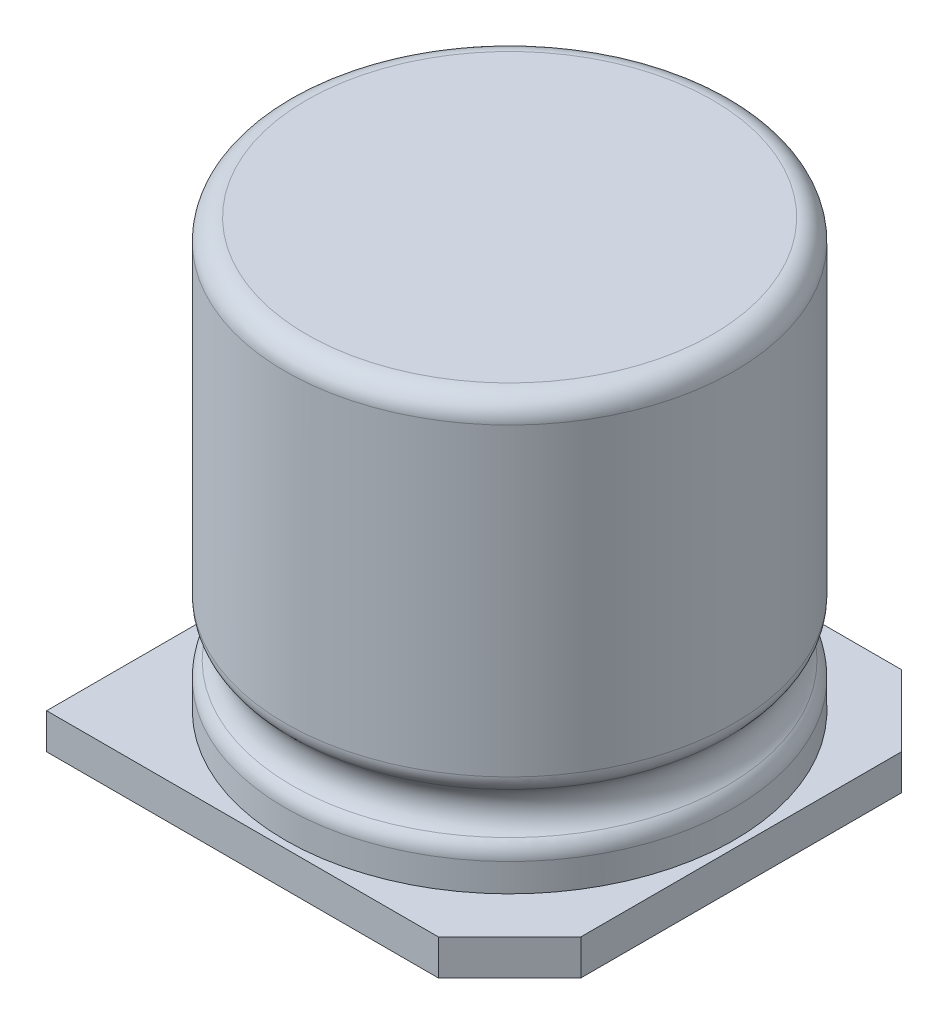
ISO-10303-21;
HEADER;
FILE_DESCRIPTION(('STEP AP214'),'2;1');
FILE_NAME('part.step','',(''),(''),'','','');
FILE_SCHEMA(('AUTOMOTIVE_DESIGN { 1 0 10303 214 1 1 1 1 }'));
ENDSEC;
DATA;
#1=APPLICATION_CONTEXT('core data for automotive mechanical design processes');
#2=APPLICATION_PROTOCOL_DEFINITION('international standard','automotive_design',2000,#1);
#3=PRODUCT_CONTEXT('',#1,'mechanical');
#4=PRODUCT('Part','Part','',(#3));
#5=PRODUCT_RELATED_PRODUCT_CATEGORY('part','',(#4));
#6=PRODUCT_DEFINITION_FORMATION('','',#4);
#7=PRODUCT_DEFINITION_CONTEXT('part definition',#1,'design');
#8=PRODUCT_DEFINITION('design','',#6,#7);
#9=PRODUCT_DEFINITION_SHAPE('','',#8);
#10=(LENGTH_UNIT() NAMED_UNIT(*) SI_UNIT(.MILLI.,.METRE.));
#11=(NAMED_UNIT(*) PLANE_ANGLE_UNIT() SI_UNIT($,.RADIAN.));
#12=(NAMED_UNIT(*) SI_UNIT($,.STERADIAN.) SOLID_ANGLE_UNIT());
#13=UNCERTAINTY_MEASURE_WITH_UNIT(LENGTH_MEASURE(1.E-05),#10,'distance_accuracy_value','');
#14=(GEOMETRIC_REPRESENTATION_CONTEXT(3) GLOBAL_UNCERTAINTY_ASSIGNED_CONTEXT((#13)) GLOBAL_UNIT_ASSIGNED_CONTEXT((#10,
#11,#12)) REPRESENTATION_CONTEXT('',''));
#15=CARTESIAN_POINT('',(0.,0.,0.));
#16=DIRECTION('',(0.,0.,1.));
#17=DIRECTION('',(1.,0.,0.));
#18=AXIS2_PLACEMENT_3D('',#15,#16,#17);
#19=CARTESIAN_POINT('',(27.23190081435,15.9331409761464,-31.0464200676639));
#20=DIRECTION('',(0.,1.,0.));
#21=DIRECTION('',(-1.,0.,0.));
#22=AXIS2_PLACEMENT_3D('',#19,#20,#21);
#23=PLANE('',#22);
#24=CARTESIAN_POINT('',(21.58548081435,15.9331409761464,-25.4000000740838));
#25=DIRECTION('',(0.,-1.,0.));
#26=DIRECTION('',(1.,0.,1.39308271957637E-12));
#27=AXIS2_PLACEMENT_3D('',#24,#25,#26);
#28=CIRCLE('',#27,5.42924999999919);
#29=CARTESIAN_POINT('',(16.1562308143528,15.9331409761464,-25.4000000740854));
#30=VERTEX_POINT('',#29);
#31=CARTESIAN_POINT('',(27.0147308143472,15.9331409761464,-25.4000000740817));
#32=VERTEX_POINT('',#31);
#33=EDGE_CURVE('E102',#30,#32,#28,.F.);
#34=ORIENTED_EDGE('',*,*,#33,.T.);
#35=CARTESIAN_POINT('',(16.1562308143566,15.9331409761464,-25.4000000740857));
#36=CARTESIAN_POINT('',(16.1562306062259,15.9331409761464,-25.4323033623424));
#37=CARTESIAN_POINT('',(16.1565187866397,15.9331409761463,-25.4646066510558));
#38=CARTESIAN_POINT('',(16.1576716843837,15.9331409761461,-25.529202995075));
#39=CARTESIAN_POINT('',(16.1585364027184,15.933140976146,-25.5614960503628));
#40=CARTESIAN_POINT('',(16.1608421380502,15.9331409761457,-25.6260616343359));
#41=CARTESIAN_POINT('',(16.1622831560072,15.9331409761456,-25.6583341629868));
#42=CARTESIAN_POINT('',(16.1657410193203,15.9331409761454,-25.7228484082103));
#43=CARTESIAN_POINT('',(16.1677578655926,15.9331409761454,-25.7550901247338));
#44=CARTESIAN_POINT('',(16.1723667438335,15.9331409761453,-25.8195324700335));
#45=CARTESIAN_POINT('',(16.1749587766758,15.9331409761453,-25.8517330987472));
#46=CARTESIAN_POINT('',(16.1807171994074,15.9331409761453,-25.9160830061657));
#47=CARTESIAN_POINT('',(16.1838835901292,15.9331409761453,-25.948232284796));
#48=CARTESIAN_POINT('',(16.1907897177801,15.9331409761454,-26.0124692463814));
#49=CARTESIAN_POINT('',(16.1945294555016,15.9331409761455,-26.0445569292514));
#50=CARTESIAN_POINT('',(16.2025810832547,15.9331409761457,-26.1086604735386));
#51=CARTESIAN_POINT('',(16.20689297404,15.9331409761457,-26.1406763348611));
#52=CARTESIAN_POINT('',(16.2160875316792,15.9331409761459,-26.2046260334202));
#53=CARTESIAN_POINT('',(16.2209701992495,15.933140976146,-26.2365598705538));
#54=CARTESIAN_POINT('',(16.2313047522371,15.9331409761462,-26.3003353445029));
#55=CARTESIAN_POINT('',(16.2367566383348,15.9331409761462,-26.3321769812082));
#56=CARTESIAN_POINT('',(16.2482278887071,15.9331409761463,-26.3957579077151));
#57=CARTESIAN_POINT('',(16.2542472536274,15.9331409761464,-26.4274971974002));
#58=CARTESIAN_POINT('',(16.2668515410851,15.9331409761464,-26.4908633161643));
#59=CARTESIAN_POINT('',(16.2734364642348,15.9331409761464,-26.5224901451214));
#60=CARTESIAN_POINT('',(16.287169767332,15.9331409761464,-26.5856212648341));
#61=CARTESIAN_POINT('',(16.29431814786,15.9331409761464,-26.6171255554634));
#62=CARTESIAN_POINT('',(16.309176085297,15.9331409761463,-26.6800015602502));
#63=CARTESIAN_POINT('',(16.3168856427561,15.9331409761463,-26.7113732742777));
#64=CARTESIAN_POINT('',(16.3328634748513,15.9331409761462,-26.7739741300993));
#65=CARTESIAN_POINT('',(16.3411317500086,15.9331409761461,-26.8052032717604));
#66=CARTESIAN_POINT('',(16.3582243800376,15.9331409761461,-26.8675090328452));
#67=CARTESIAN_POINT('',(16.3670487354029,15.933140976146,-26.8985856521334));
#68=CARTESIAN_POINT('',(16.3852507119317,15.933140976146,-26.9605764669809));
#69=CARTESIAN_POINT('',(16.3946283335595,15.933140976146,-26.9914906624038));
#70=CARTESIAN_POINT('',(16.413933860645,15.933140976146,-27.053146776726));
#71=CARTESIAN_POINT('',(16.4238617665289,15.933140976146,-27.083888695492));
#72=CARTESIAN_POINT('',(16.4442647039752,15.9331409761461,-27.1451904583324));
#73=CARTESIAN_POINT('',(16.4547397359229,15.9331409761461,-27.1757503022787));
#74=CARTESIAN_POINT('',(16.4762335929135,15.9331409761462,-27.2366781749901));
#75=CARTESIAN_POINT('',(16.4872524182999,15.9331409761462,-27.2670462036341));
#76=CARTESIAN_POINT('',(16.5098303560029,15.9331409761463,-27.3275807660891));
#77=CARTESIAN_POINT('',(16.5213894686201,15.9331409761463,-27.3577472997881));
#78=CARTESIAN_POINT('',(16.5450443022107,15.9331409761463,-27.4178692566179));
#79=CARTESIAN_POINT('',(16.557140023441,15.9331409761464,-27.4478246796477));
#80=CARTESIAN_POINT('',(16.5818642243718,15.9331409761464,-27.507514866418));
#81=CARTESIAN_POINT('',(16.5944927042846,15.9331409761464,-27.5372496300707));
#82=CARTESIAN_POINT('',(16.6202784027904,15.9331409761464,-27.5964890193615));
#83=CARTESIAN_POINT('',(16.6334356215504,15.9331409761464,-27.6259936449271));
#84=CARTESIAN_POINT('',(16.6602746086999,15.9331409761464,-27.6847633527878));
#85=CARTESIAN_POINT('',(16.6739563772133,15.9331409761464,-27.7140284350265));
#86=CARTESIAN_POINT('',(16.7018401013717,15.9331409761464,-27.7723097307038));
#87=CARTESIAN_POINT('',(16.7160420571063,15.9331409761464,-27.8013259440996));
#88=CARTESIAN_POINT('',(16.7449616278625,15.9331409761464,-27.8591002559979));
#89=CARTESIAN_POINT('',(16.7596792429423,15.9331409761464,-27.8878583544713));
#90=CARTESIAN_POINT('',(16.7896254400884,15.9331409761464,-27.9451072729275));
#91=CARTESIAN_POINT('',(16.8048540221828,15.9331409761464,-27.9735980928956));
#92=CARTESIAN_POINT('',(16.8358172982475,15.9331409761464,-28.030303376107));
#93=CARTESIAN_POINT('',(16.851551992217,15.9331409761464,-28.0585178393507));
#94=CARTESIAN_POINT('',(16.883522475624,15.9331409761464,-28.1146614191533));
#95=CARTESIAN_POINT('',(16.8997582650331,15.9331409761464,-28.1425905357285));
#96=CARTESIAN_POINT('',(16.9327257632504,15.9331409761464,-28.1981545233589));
#97=CARTESIAN_POINT('',(16.9494574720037,15.9331409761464,-28.2257893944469));
#98=CARTESIAN_POINT('',(16.9834114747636,15.9331409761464,-28.2807560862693));
#99=CARTESIAN_POINT('',(17.00063376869,15.9331409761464,-28.3080879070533));
#100=CARTESIAN_POINT('',(17.0355634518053,15.9331409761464,-28.3624397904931));
#101=CARTESIAN_POINT('',(17.0532708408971,15.9331409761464,-28.3894598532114));
#102=CARTESIAN_POINT('',(17.0891650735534,15.9331409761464,-28.4431796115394));
#103=CARTESIAN_POINT('',(17.1073519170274,15.9331409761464,-28.4698793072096));
#104=CARTESIAN_POINT('',(17.1441992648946,15.9331409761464,-28.522949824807));
#105=CARTESIAN_POINT('',(17.1628597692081,15.9331409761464,-28.5493206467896));
#106=CARTESIAN_POINT('',(17.2006484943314,15.9331409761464,-28.6017250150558));
#107=CARTESIAN_POINT('',(17.2197767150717,15.9331409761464,-28.6277585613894));
#108=CARTESIAN_POINT('',(17.2584947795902,15.9331409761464,-28.6794800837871));
#109=CARTESIAN_POINT('',(17.2780846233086,15.9331409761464,-28.7051680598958));
#110=CARTESIAN_POINT('',(17.3177196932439,15.9331409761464,-28.7561902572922));
#111=CARTESIAN_POINT('',(17.3377649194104,15.9331409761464,-28.7815244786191));
#112=CARTESIAN_POINT('',(17.3783043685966,15.9331409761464,-28.8318310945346));
#113=CARTESIAN_POINT('',(17.3987985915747,15.9331409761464,-28.8568034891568));
#114=CARTESIAN_POINT('',(17.440229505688,15.9331409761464,-28.906378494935));
#115=CARTESIAN_POINT('',(17.4611661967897,15.9331409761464,-28.9309811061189));
#116=CARTESIAN_POINT('',(17.503475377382,15.9331409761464,-28.9798087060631));
#117=CARTESIAN_POINT('',(17.5248478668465,15.9331409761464,-29.0040336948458));
#118=CARTESIAN_POINT('',(17.5680218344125,15.9331409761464,-29.0520983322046));
#119=CARTESIAN_POINT('',(17.5898233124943,15.9331409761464,-29.0759379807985));
#120=CARTESIAN_POINT('',(17.6338483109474,15.9331409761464,-29.1232243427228));
#121=CARTESIAN_POINT('',(17.656071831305,15.9331409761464,-29.1466710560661));
#122=CARTESIAN_POINT('',(17.7009338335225,15.9331409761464,-29.1931640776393));
#123=CARTESIAN_POINT('',(17.7235723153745,15.9331409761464,-29.2162103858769));
#124=CARTESIAN_POINT('',(17.7692570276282,15.9331409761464,-29.2618952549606));
#125=CARTESIAN_POINT('',(17.7923032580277,15.9331409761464,-29.2845338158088));
#126=CARTESIAN_POINT('',(17.8387961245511,15.9331409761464,-29.329395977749));
#127=CARTESIAN_POINT('',(17.8622427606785,15.9331409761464,-29.3516195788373));
#128=CARTESIAN_POINT('',(17.9095289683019,15.9331409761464,-29.3956447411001));
#129=CARTESIAN_POINT('',(17.9333685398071,15.9331409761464,-29.4174463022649));
#130=CARTESIAN_POINT('',(17.9814330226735,15.9331409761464,-29.4606204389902));
#131=CARTESIAN_POINT('',(18.0056579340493,15.9331409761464,-29.4819930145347));
#132=CARTESIAN_POINT('',(18.0544853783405,15.9331409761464,-29.524302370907));
#133=CARTESIAN_POINT('',(18.0790879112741,15.9331409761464,-29.5452391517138));
#134=CARTESIAN_POINT('',(18.1286627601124,15.9331409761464,-29.5866702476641));
#135=CARTESIAN_POINT('',(18.1536350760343,15.9331409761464,-29.6071645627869));
#136=CARTESIAN_POINT('',(18.203941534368,15.9331409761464,-29.6477041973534));
#137=CARTESIAN_POINT('',(18.2292756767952,15.9331409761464,-29.6677495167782));
#138=CARTESIAN_POINT('',(18.2802977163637,15.9331409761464,-29.7073847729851));
#139=CARTESIAN_POINT('',(18.3059856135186,15.9331409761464,-29.72697470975));
#140=CARTESIAN_POINT('',(18.3577069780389,15.9331409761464,-29.7656929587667));
#141=CARTESIAN_POINT('',(18.383740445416,15.9331409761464,-29.7848212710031));
#142=CARTESIAN_POINT('',(18.4361446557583,15.9331409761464,-29.8226101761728));
#143=CARTESIAN_POINT('',(18.4625153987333,15.9331409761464,-29.8412707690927));
#144=CARTESIAN_POINT('',(18.5155857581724,15.9331409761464,-29.8781182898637));
#145=CARTESIAN_POINT('',(18.5422853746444,15.9331409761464,-29.8963052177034));
#146=CARTESIAN_POINT('',(18.5960049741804,15.9331409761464,-29.9321996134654));
#147=CARTESIAN_POINT('',(18.6230249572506,15.9331409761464,-29.9499070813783));
#148=CARTESIAN_POINT('',(18.6773766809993,15.9331409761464,-29.9848369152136));
#149=CARTESIAN_POINT('',(18.7047084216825,15.9331409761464,-30.0020592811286));
#150=CARTESIAN_POINT('',(18.7596749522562,15.9331409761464,-30.0360134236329));
#151=CARTESIAN_POINT('',(18.7873097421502,15.9331409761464,-30.0527452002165));
#152=CARTESIAN_POINT('',(18.8428735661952,15.9331409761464,-30.0857128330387));
#153=CARTESIAN_POINT('',(18.8708026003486,15.9331409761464,-30.1019486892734));
#154=CARTESIAN_POINT('',(18.9269460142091,15.9331409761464,-30.1339193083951));
#155=CARTESIAN_POINT('',(18.9551603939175,15.9331409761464,-30.14965407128));
#156=CARTESIAN_POINT('',(19.0118655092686,15.9331409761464,-30.1806174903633));
#157=CARTESIAN_POINT('',(19.0403562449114,15.9331409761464,-30.1958461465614));
#158=CARTESIAN_POINT('',(19.0976049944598,15.9331409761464,-30.2257925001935));
#159=CARTESIAN_POINT('',(19.1263630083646,15.9331409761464,-30.2405101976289));
#160=CARTESIAN_POINT('',(19.184137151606,15.9331409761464,-30.2694299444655));
#161=CARTESIAN_POINT('',(19.2131532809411,15.9331409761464,-30.2836319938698));
#162=CARTESIAN_POINT('',(19.2714344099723,15.9331409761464,-30.3115159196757));
#163=CARTESIAN_POINT('',(19.3006994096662,15.9331409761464,-30.3251977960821));
#164=CARTESIAN_POINT('',(19.3594689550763,15.9331409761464,-30.3520370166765));
#165=CARTESIAN_POINT('',(19.3889735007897,15.9331409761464,-30.3651943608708));
#166=CARTESIAN_POINT('',(19.4482127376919,15.9331409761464,-30.3909803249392));
#167=CARTESIAN_POINT('',(19.4779474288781,15.9331409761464,-30.4036089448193));
#168=CARTESIAN_POINT('',(19.5376374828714,15.9331409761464,-30.4283334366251));
#169=CARTESIAN_POINT('',(19.5675928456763,15.9331409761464,-30.4404293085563));
#170=CARTESIAN_POINT('',(19.6277146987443,15.9331409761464,-30.4640844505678));
#171=CARTESIAN_POINT('',(19.6578811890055,15.9331409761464,-30.475643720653));
#172=CARTESIAN_POINT('',(19.7184156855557,15.9331409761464,-30.4982219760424));
#173=CARTESIAN_POINT('',(19.7487836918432,15.9331409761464,-30.5092409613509));
#174=CARTESIAN_POINT('',(19.8097115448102,15.9331409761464,-30.5307351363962));
#175=CARTESIAN_POINT('',(19.8402713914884,15.9331409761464,-30.5412103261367));
#176=CARTESIAN_POINT('',(19.9015731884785,15.9331409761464,-30.5616135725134));
#177=CARTESIAN_POINT('',(19.9323151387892,15.9331409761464,-30.5715416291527));
#178=CARTESIAN_POINT('',(19.9939713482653,15.9331409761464,-30.5908474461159));
#179=CARTESIAN_POINT('',(20.0248856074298,15.9331409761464,-30.6002252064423));
#180=CARTESIAN_POINT('',(20.0868765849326,15.9331409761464,-30.6184274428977));
#181=CARTESIAN_POINT('',(20.1179533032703,15.9331409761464,-30.6272519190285));
#182=CARTESIAN_POINT('',(20.1802592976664,15.9331409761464,-30.6443447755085));
#183=CARTESIAN_POINT('',(20.2114885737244,15.9331409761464,-30.652613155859));
#184=CARTESIAN_POINT('',(20.2740897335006,15.9331409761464,-30.6685911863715));
#185=CARTESIAN_POINT('',(20.3054616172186,15.9331409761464,-30.6763008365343));
#186=CARTESIAN_POINT('',(20.3683379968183,15.9331409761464,-30.6911589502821));
#187=CARTESIAN_POINT('',(20.3998424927,15.9331409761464,-30.6983074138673));
#188=CARTESIAN_POINT('',(20.4629740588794,15.9331409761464,-30.7120408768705));
#189=CARTESIAN_POINT('',(20.4946011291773,15.9331409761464,-30.7186258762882));
#190=CARTESIAN_POINT('',(20.5579677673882,15.9331409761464,-30.7312303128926));
#191=CARTESIAN_POINT('',(20.5897073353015,15.9331409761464,-30.7372497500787));
#192=CARTESIAN_POINT('',(20.6532888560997,15.9331409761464,-30.7487211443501));
#193=CARTESIAN_POINT('',(20.685130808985,15.9331409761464,-30.7541731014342));
#194=CARTESIAN_POINT('',(20.748906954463,15.9331409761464,-30.7645077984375));
#195=CARTESIAN_POINT('',(20.7808411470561,15.9331409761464,-30.7693905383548));
#196=CARTESIAN_POINT('',(20.8447915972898,15.9331409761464,-30.7785852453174));
#197=CARTESIAN_POINT('',(20.8768078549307,15.9331409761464,-30.7828972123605));
#198=CARTESIAN_POINT('',(20.9409122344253,15.9331409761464,-30.7909489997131));
#199=CARTESIAN_POINT('',(20.9730003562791,15.9331409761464,-30.7946888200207));
#200=CARTESIAN_POINT('',(21.0372382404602,15.9331409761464,-30.8015951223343));
#201=CARTESIAN_POINT('',(21.0693880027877,15.9331409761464,-30.8047616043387));
#202=CARTESIAN_POINT('',(21.1337389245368,15.9331409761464,-30.810520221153));
#203=CARTESIAN_POINT('',(21.1659400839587,15.9331409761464,-30.8131123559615));
#204=CARTESIAN_POINT('',(21.2303835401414,15.9331409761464,-30.8177214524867));
#205=CARTESIAN_POINT('',(21.2626258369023,15.9331409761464,-30.8197384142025));
#206=CARTESIAN_POINT('',(21.3271412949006,15.9331409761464,-30.8231965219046));
#207=CARTESIAN_POINT('',(21.3594144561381,15.9331409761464,-30.8246376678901));
#208=CARTESIAN_POINT('',(21.423981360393,15.9331409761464,-30.8269436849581));
#209=CARTESIAN_POINT('',(21.4562751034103,15.9331409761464,-30.82780855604));
#210=CARTESIAN_POINT('',(21.5208728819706,15.9331409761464,-30.8289617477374));
#211=CARTESIAN_POINT('',(21.5531769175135,15.9331409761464,-30.8292500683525));
#212=CARTESIAN_POINT('',(21.6177849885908,15.9331409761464,-30.8292500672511));
#213=CARTESIAN_POINT('',(21.6500890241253,15.9331409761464,-30.8289617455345));
#214=CARTESIAN_POINT('',(21.7146868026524,15.9331409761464,-30.827808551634));
#215=CARTESIAN_POINT('',(21.746980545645,15.9331409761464,-30.8269436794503));
#216=CARTESIAN_POINT('',(21.8115474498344,15.9331409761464,-30.8246376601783));
#217=CARTESIAN_POINT('',(21.8438206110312,15.9331409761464,-30.8231965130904));
#218=CARTESIAN_POINT('',(21.9083360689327,15.9331409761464,-30.8197384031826));
#219=CARTESIAN_POINT('',(21.9405783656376,15.9331409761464,-30.8177214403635));
#220=CARTESIAN_POINT('',(22.0050218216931,15.9331409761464,-30.8131123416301));
#221=CARTESIAN_POINT('',(22.0372229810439,15.9331409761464,-30.8105202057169));
#222=CARTESIAN_POINT('',(22.1015739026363,15.9331409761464,-30.8047615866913));
#223=CARTESIAN_POINT('',(22.1337236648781,15.9331409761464,-30.8015951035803));
#224=CARTESIAN_POINT('',(22.1979615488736,15.9331409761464,-30.7946887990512));
#225=CARTESIAN_POINT('',(22.2300496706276,15.9331409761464,-30.7909489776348));
#226=CARTESIAN_POINT('',(22.2941540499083,15.9331409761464,-30.7828971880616));
#227=CARTESIAN_POINT('',(22.3261703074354,15.9331409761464,-30.7785852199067));
#228=CARTESIAN_POINT('',(22.3901207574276,15.9331409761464,-30.7693905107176));
#229=CARTESIAN_POINT('',(22.4220549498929,15.9331409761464,-30.7645077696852));
#230=CARTESIAN_POINT('',(22.4858310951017,15.9331409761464,-30.7541730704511));
#231=CARTESIAN_POINT('',(22.5176730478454,15.9331409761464,-30.7487211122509));
#232=CARTESIAN_POINT('',(22.581254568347,15.9331409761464,-30.737249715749));
#233=CARTESIAN_POINT('',(22.6129941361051,15.9331409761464,-30.7312302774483));
#234=CARTESIAN_POINT('',(22.6763607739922,15.9331409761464,-30.7186258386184));
#235=CARTESIAN_POINT('',(22.7079878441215,15.9331409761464,-30.7120408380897));
#236=CARTESIAN_POINT('',(22.7711194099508,15.9331409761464,-30.6983073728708));
#237=CARTESIAN_POINT('',(22.8026239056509,15.9331409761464,-30.6911589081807));
#238=CARTESIAN_POINT('',(22.8655002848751,15.9331409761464,-30.6763007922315));
#239=CARTESIAN_POINT('',(22.8968721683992,15.9331409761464,-30.6685911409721));
#240=CARTESIAN_POINT('',(22.9594733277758,15.9331409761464,-30.652613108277));
#241=CARTESIAN_POINT('',(22.9907026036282,15.9331409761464,-30.6443447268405));
#242=CARTESIAN_POINT('',(23.0530085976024,15.9331409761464,-30.6272518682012));
#243=CARTESIAN_POINT('',(23.0840853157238,15.9331409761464,-30.6184273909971));
#244=CARTESIAN_POINT('',(23.1460762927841,15.9331409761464,-30.6002251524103));
#245=CARTESIAN_POINT('',(23.1769905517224,15.9331409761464,-30.5908473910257));
#246=CARTESIAN_POINT('',(23.238646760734,15.9331409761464,-30.5715415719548));
#247=CARTESIAN_POINT('',(23.2693887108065,15.9331409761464,-30.5616135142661));
#248=CARTESIAN_POINT('',(23.3306905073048,15.9331409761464,-30.5412102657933));
#249=CARTESIAN_POINT('',(23.3612503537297,15.9331409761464,-30.5307350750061));
#250=CARTESIAN_POINT('',(23.4221782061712,15.9331409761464,-30.5092408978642));
#251=CARTESIAN_POINT('',(23.4525462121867,15.9331409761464,-30.4982219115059));
#252=CARTESIAN_POINT('',(23.5130807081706,15.9331409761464,-30.4756436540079));
#253=CARTESIAN_POINT('',(23.5432471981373,15.9331409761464,-30.4640843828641));
#254=CARTESIAN_POINT('',(23.6033690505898,15.9331409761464,-30.4404292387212));
#255=CARTESIAN_POINT('',(23.6333244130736,15.9331409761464,-30.4283333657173));
#256=CARTESIAN_POINT('',(23.6930144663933,15.9331409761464,-30.4036088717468));
#257=CARTESIAN_POINT('',(23.722749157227,15.9331409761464,-30.3909802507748));
#258=CARTESIAN_POINT('',(23.7819883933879,15.9331409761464,-30.3651942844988));
#259=CARTESIAN_POINT('',(23.8114929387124,15.9331409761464,-30.3520369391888));
#260=CARTESIAN_POINT('',(23.8702624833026,15.9331409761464,-30.3251977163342));
#261=CARTESIAN_POINT('',(23.8995274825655,15.9331409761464,-30.3115158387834));
#262=CARTESIAN_POINT('',(23.9578086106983,15.9331409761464,-30.2836319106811));
#263=CARTESIAN_POINT('',(23.9868247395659,15.9331409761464,-30.2694298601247));
#264=CARTESIAN_POINT('',(24.0445988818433,15.9331409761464,-30.2405101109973));
#265=CARTESIAN_POINT('',(24.0733568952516,15.9331409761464,-30.2257924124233));
#266=CARTESIAN_POINT('',(24.1306056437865,15.9331409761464,-30.1958460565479));
#267=CARTESIAN_POINT('',(24.1590963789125,15.9331409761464,-30.1806173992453));
#268=CARTESIAN_POINT('',(24.2158014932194,15.9331409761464,-30.1496539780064));
#269=CARTESIAN_POINT('',(24.2440158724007,15.9331409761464,-30.1339192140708));
#270=CARTESIAN_POINT('',(24.300159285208,15.9331409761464,-30.1019485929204));
#271=CARTESIAN_POINT('',(24.3280883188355,15.9331409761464,-30.085712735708));
#272=CARTESIAN_POINT('',(24.3836521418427,15.9331409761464,-30.0527451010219));
#273=CARTESIAN_POINT('',(24.4112869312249,15.9331409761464,-30.0360133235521));
#274=CARTESIAN_POINT('',(24.466253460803,15.9331409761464,-30.0020591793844));
#275=CARTESIAN_POINT('',(24.4935852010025,15.9331409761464,-29.9848368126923));
#276=CARTESIAN_POINT('',(24.5479369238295,15.9331409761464,-29.949906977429));
#277=CARTESIAN_POINT('',(24.5749569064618,15.9331409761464,-29.9321995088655));
#278=CARTESIAN_POINT('',(24.6286765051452,15.9331409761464,-29.8963051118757));
#279=CARTESIAN_POINT('',(24.6553761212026,15.9331409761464,-29.878118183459));
#280=CARTESIAN_POINT('',(24.7084464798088,15.9331409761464,-29.8412706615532));
#281=CARTESIAN_POINT('',(24.7348172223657,15.9331409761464,-29.8226100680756));
#282=CARTESIAN_POINT('',(24.7872214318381,15.9331409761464,-29.7848211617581));
#283=CARTESIAN_POINT('',(24.8132548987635,15.9331409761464,-29.7656928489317));
#284=CARTESIAN_POINT('',(24.8649762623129,15.9331409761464,-29.7269745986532));
#285=CARTESIAN_POINT('',(24.8906641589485,15.9331409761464,-29.7073846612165));
#286=CARTESIAN_POINT('',(24.9416861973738,15.9331409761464,-29.6677494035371));
#287=CARTESIAN_POINT('',(24.9670203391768,15.9331409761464,-29.6477040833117));
#288=CARTESIAN_POINT('',(25.0173267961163,15.9331409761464,-29.6071644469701));
#289=CARTESIAN_POINT('',(25.0422991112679,15.9331409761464,-29.5866701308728));
#290=CARTESIAN_POINT('',(25.0918739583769,15.9331409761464,-29.5452390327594));
#291=CARTESIAN_POINT('',(25.1164764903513,15.9331409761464,-29.5243022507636));
#292=CARTESIAN_POINT('',(25.1653039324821,15.9331409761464,-29.4819928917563));
#293=CARTESIAN_POINT('',(25.1895288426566,15.9331409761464,-29.4606203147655));
#294=CARTESIAN_POINT('',(25.2375933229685,15.9331409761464,-29.417446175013));
#295=CARTESIAN_POINT('',(25.2614328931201,15.9331409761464,-29.3956446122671));
#296=CARTESIAN_POINT('',(25.3087190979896,15.9331409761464,-29.3516194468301));
#297=CARTESIAN_POINT('',(25.3321657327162,15.9331409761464,-29.3293958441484));
#298=CARTESIAN_POINT('',(25.3786585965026,15.9331409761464,-29.2845336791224));
#299=CARTESIAN_POINT('',(25.4017048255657,15.9331409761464,-29.2618951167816));
#300=CARTESIAN_POINT('',(25.4473895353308,15.9331409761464,-29.2162102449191));
#301=CARTESIAN_POINT('',(25.4700280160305,15.9331409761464,-29.1931639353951));
#302=CARTESIAN_POINT('',(25.5148900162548,15.9331409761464,-29.146670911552));
#303=CARTESIAN_POINT('',(25.5371135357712,15.9331409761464,-29.123224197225));
#304=CARTESIAN_POINT('',(25.5811385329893,15.9331409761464,-29.0759378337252));
#305=CARTESIAN_POINT('',(25.6029400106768,15.9331409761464,-29.0520981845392));
#306=CARTESIAN_POINT('',(25.6461139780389,15.9331409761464,-29.0040335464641));
#307=CARTESIAN_POINT('',(25.6674864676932,15.9331409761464,-28.9798085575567));
#308=CARTESIAN_POINT('',(25.7097956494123,15.9331409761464,-28.930980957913));
#309=CARTESIAN_POINT('',(25.7307323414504,15.9331409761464,-28.9063783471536));
#310=CARTESIAN_POINT('',(25.7721632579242,15.9331409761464,-28.8568033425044));
#311=CARTESIAN_POINT('',(25.7926574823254,15.9331409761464,-28.8318309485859));
#312=CARTESIAN_POINT('',(25.8331969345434,15.9331409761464,-28.7815243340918));
#313=CARTESIAN_POINT('',(25.8532421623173,15.9331409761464,-28.7561901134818));
#314=CARTESIAN_POINT('',(25.8928772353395,15.9331409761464,-28.7051679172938));
#315=CARTESIAN_POINT('',(25.9124670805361,15.9331409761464,-28.6794799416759));
#316=CARTESIAN_POINT('',(25.9511851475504,15.9331409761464,-28.6277584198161));
#317=CARTESIAN_POINT('',(25.9703133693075,15.9331409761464,-28.601724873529));
#318=CARTESIAN_POINT('',(26.008102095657,15.9331409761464,-28.5493205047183));
#319=CARTESIAN_POINT('',(26.0267626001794,15.9331409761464,-28.5229496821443));
#320=CARTESIAN_POINT('',(26.0636099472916,15.9331409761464,-28.4698791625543));
#321=CARTESIAN_POINT('',(26.0817967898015,15.9331409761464,-28.4431794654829));
#322=CARTESIAN_POINT('',(26.117691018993,15.9331409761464,-28.3894597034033));
#323=CARTESIAN_POINT('',(26.1353984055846,15.9331409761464,-28.362439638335));
#324=CARTESIAN_POINT('',(26.1703280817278,15.9331409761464,-28.3080877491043));
#325=CARTESIAN_POINT('',(26.1875503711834,15.9331409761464,-28.2807559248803));
#326=CARTESIAN_POINT('',(26.2215043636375,15.9331409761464,-28.2257892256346));
#327=CARTESIAN_POINT('',(26.2382360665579,15.9331409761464,-28.1981543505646));
#328=CARTESIAN_POINT('',(26.271203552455,15.9331409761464,-28.1425903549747));
#329=CARTESIAN_POINT('',(26.2874393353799,15.9331409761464,-28.114661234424));
#330=CARTESIAN_POINT('',(26.3194098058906,15.9331409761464,-28.0585176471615));
#331=CARTESIAN_POINT('',(26.3351444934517,15.9331409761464,-28.0303031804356));
#332=CARTESIAN_POINT('',(26.3661077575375,15.9331409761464,-27.9735978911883));
#333=CARTESIAN_POINT('',(26.3813363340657,15.9331409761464,-27.9451070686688));
#334=CARTESIAN_POINT('',(26.41128252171,15.9331409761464,-27.8878581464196));
#335=CARTESIAN_POINT('',(26.426000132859,15.9331409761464,-27.8591000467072));
#336=CARTESIAN_POINT('',(26.4549196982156,15.9331409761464,-27.8013257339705));
#337=CARTESIAN_POINT('',(26.4691216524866,15.9331409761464,-27.772309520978));
#338=CARTESIAN_POINT('',(26.4970053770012,15.9331409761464,-27.7140282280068));
#339=CARTESIAN_POINT('',(26.5106871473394,15.9331409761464,-27.6847631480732));
#340=CARTESIAN_POINT('',(26.5375261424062,15.9331409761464,-27.6259934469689));
#341=CARTESIAN_POINT('',(26.550683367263,15.9331409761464,-27.5964888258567));
#342=CARTESIAN_POINT('',(26.5764690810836,15.9331409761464,-27.537249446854));
#343=CARTESIAN_POINT('',(26.5890975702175,15.9331409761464,-27.5075146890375));
#344=CARTESIAN_POINT('',(26.6138217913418,15.9331409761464,-27.4478245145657));
#345=CARTESIAN_POINT('',(26.6259175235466,15.9331409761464,-27.4178690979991));
#346=CARTESIAN_POINT('',(26.6495723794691,15.9331409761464,-27.357747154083));
#347=CARTESIAN_POINT('',(26.6611315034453,15.9331409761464,-27.3275806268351));
#348=CARTESIAN_POINT('',(26.6837094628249,15.9331409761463,-27.2670460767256));
#349=CARTESIAN_POINT('',(26.6947282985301,15.9331409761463,-27.2366780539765));
#350=CARTESIAN_POINT('',(26.7162221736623,15.9331409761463,-27.1757501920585));
#351=CARTESIAN_POINT('',(26.7266972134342,15.9331409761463,-27.1451903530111));
#352=CARTESIAN_POINT('',(26.7471001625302,15.9331409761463,-27.0838885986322));
#353=CARTESIAN_POINT('',(26.7570280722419,15.9331409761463,-27.0531466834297));
#354=CARTESIAN_POINT('',(26.7763336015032,15.9331409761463,-26.9914905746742));
#355=CARTESIAN_POINT('',(26.7857112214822,15.9331409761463,-26.9605763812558));
#356=CARTESIAN_POINT('',(26.803913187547,15.9331409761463,-26.8985855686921));
#357=CARTESIAN_POINT('',(26.812737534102,15.9331409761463,-26.8675089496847));
#358=CARTESIAN_POINT('',(26.8298301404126,15.9331409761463,-26.805203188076));
#359=CARTESIAN_POINT('',(26.838098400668,15.9331409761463,-26.7739740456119));
#360=CARTESIAN_POINT('',(26.8540761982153,15.9331409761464,-26.7113731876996));
#361=CARTESIAN_POINT('',(26.8617857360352,15.9331409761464,-26.6800014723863));
#362=CARTESIAN_POINT('',(26.8766436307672,15.9331409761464,-26.6171254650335));
#363=CARTESIAN_POINT('',(26.8837919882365,15.9331409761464,-26.5856211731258));
#364=CARTESIAN_POINT('',(26.8975252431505,15.9331409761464,-26.5224900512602));
#365=CARTESIAN_POINT('',(26.9041101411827,15.9331409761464,-26.4908632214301));
#366=CARTESIAN_POINT('',(26.916714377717,15.9331409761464,-26.4274971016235));
#367=CARTESIAN_POINT('',(26.922733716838,15.9331409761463,-26.3957578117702));
#368=CARTESIAN_POINT('',(26.9342049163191,15.9331409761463,-26.3321768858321));
#369=CARTESIAN_POINT('',(26.9396567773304,15.9331409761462,-26.3003352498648));
#370=CARTESIAN_POINT('',(26.9499912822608,15.9331409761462,-26.2365597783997));
#371=CARTESIAN_POINT('',(26.9548739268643,15.9331409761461,-26.2046259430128));
#372=CARTESIAN_POINT('',(26.9640684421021,15.933140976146,-26.1406762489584));
#373=CARTESIAN_POINT('',(26.9683803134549,15.933140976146,-26.1086603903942));
#374=CARTESIAN_POINT('',(26.9764319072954,15.9331409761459,-26.0445568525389));
#375=CARTESIAN_POINT('',(26.9801716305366,15.9331409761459,-26.0124691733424));
#376=CARTESIAN_POINT('',(26.9870777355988,15.9331409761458,-25.9482322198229));
#377=CARTESIAN_POINT('',(26.9902441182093,15.9331409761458,-25.9160829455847));
#378=CARTESIAN_POINT('',(26.996002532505,15.9331409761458,-25.851733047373));
#379=CARTESIAN_POINT('',(26.9985945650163,15.9331409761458,-25.8195324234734));
#380=CARTESIAN_POINT('',(27.0032034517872,15.9331409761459,-25.755090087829));
#381=CARTESIAN_POINT('',(27.0052203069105,15.9331409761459,-25.7228483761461));
#382=CARTESIAN_POINT('',(27.0086781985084,15.933140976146,-25.6583341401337));
#383=CARTESIAN_POINT('',(27.0101192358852,15.9331409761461,-25.6260616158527));
#384=CARTESIAN_POINT('',(27.0124250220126,15.9331409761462,-25.5614960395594));
#385=CARTESIAN_POINT('',(27.0132897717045,15.9331409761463,-25.5292029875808));
#386=CARTESIAN_POINT('',(27.0144427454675,15.9331409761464,-25.4646066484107));
#387=CARTESIAN_POINT('',(27.0147309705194,15.9331409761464,-25.4323033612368));
#388=CARTESIAN_POINT('',(27.0147308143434,15.9331409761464,-25.4000000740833));
#389=B_SPLINE_CURVE_WITH_KNOTS('',3,(#35,#36,#37,#38,#39,#40,#41,#42,#43,#44,#45,#46,#47,#48,
#49,#50,#51,#52,#53,#54,#55,#56,#57,#58,#59,#60,#61,#62,#63,#64,#65,#66,#67,#68,#69,#70,#71,#72,
#73,#74,#75,#76,#77,#78,#79,#80,#81,#82,#83,#84,#85,#86,#87,#88,#89,#90,#91,#92,#93,#94,#95,#96,
#97,#98,#99,#100,#101,#102,#103,#104,#105,#106,#107,#108,#109,#110,#111,#112,#113,#114,#115,
#116,#117,#118,#119,#120,#121,#122,#123,#124,#125,#126,#127,#128,#129,#130,#131,#132,#133,#134,
#135,#136,#137,#138,#139,#140,#141,#142,#143,#144,#145,#146,#147,#148,#149,#150,#151,#152,#153,
#154,#155,#156,#157,#158,#159,#160,#161,#162,#163,#164,#165,#166,#167,#168,#169,#170,#171,#172,
#173,#174,#175,#176,#177,#178,#179,#180,#181,#182,#183,#184,#185,#186,#187,#188,#189,#190,#191,
#192,#193,#194,#195,#196,#197,#198,#199,#200,#201,#202,#203,#204,#205,#206,#207,#208,#209,#210,
#211,#212,#213,#214,#215,#216,#217,#218,#219,#220,#221,#222,#223,#224,#225,#226,#227,#228,#229,
#230,#231,#232,#233,#234,#235,#236,#237,#238,#239,#240,#241,#242,#243,#244,#245,#246,#247,#248,
#249,#250,#251,#252,#253,#254,#255,#256,#257,#258,#259,#260,#261,#262,#263,#264,#265,#266,#267,
#268,#269,#270,#271,#272,#273,#274,#275,#276,#277,#278,#279,#280,#281,#282,#283,#284,#285,#286,
#287,#288,#289,#290,#291,#292,#293,#294,#295,#296,#297,#298,#299,#300,#301,#302,#303,#304,#305,
#306,#307,#308,#309,#310,#311,#312,#313,#314,#315,#316,#317,#318,#319,#320,#321,#322,#323,#324,
#325,#326,#327,#328,#329,#330,#331,#332,#333,#334,#335,#336,#337,#338,#339,#340,#341,#342,#343,
#344,#345,#346,#347,#348,#349,#350,#351,#352,#353,#354,#355,#356,#357,#358,#359,#360,#361,#362,
#363,#364,#365,#366,#367,#368,#369,#370,#371,#372,#373,#374,#375,#376,#377,#378,#379,#380,#381,
#382,#383,#384,#385,#386,#387,#388),.UNSPECIFIED.,.F.,.F.,(4,2,2,2,2,2,2,2,2,2,2,2,2,2,2,2,2,2,
2,2,2,2,2,2,2,2,2,2,2,2,2,2,2,2,2,2,2,2,2,2,2,2,2,2,2,2,2,2,2,2,2,2,2,2,2,2,2,2,2,2,2,2,2,2,2,2,
2,2,2,2,2,2,2,2,2,2,2,2,2,2,2,2,2,2,2,2,2,2,2,2,2,2,2,2,2,2,2,2,2,2,2,2,2,2,2,2,2,2,2,2,2,2,2,2,
2,2,2,2,2,2,2,2,2,2,2,2,2,2,2,2,2,2,2,2,2,2,2,2,2,2,2,2,2,2,2,2,2,2,2,2,2,2,2,2,2,2,2,2,2,2,2,2,
2,2,2,2,2,2,2,2,2,2,2,2,2,2,4),(0.,0.0969085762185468,0.193817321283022,0.290726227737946,
0.387635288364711,0.484544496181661,0.581453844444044,0.678363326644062,0.775272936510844,
0.872182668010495,0.969092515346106,1.06600247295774,1.16291253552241,1.25982269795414,
1.35673295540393,1.45364330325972,1.55055373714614,1.647464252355,1.74437484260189,
1.84128550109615,1.93819622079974,2.03510699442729,2.13201781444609,2.22892867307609,
2.32583956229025,2.4227504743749,2.51966140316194,2.61657234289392,2.71348328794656,
2.81039423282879,2.90730517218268,3.00421610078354,3.1011270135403,3.19803790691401,
3.29494878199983,3.39185964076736,3.48877048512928,3.58568131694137,3.6825921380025,
3.77950295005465,3.87641375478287,3.97332455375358,4.07023534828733,4.16714613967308,
4.26405692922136,4.36096771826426,4.45787850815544,4.5547893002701,4.65170009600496,
4.7486108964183,4.84552170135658,4.94243251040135,5.0393433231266,5.13625413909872,
5.23316495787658,5.33007577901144,5.42698660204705,5.52389742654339,5.62080825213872,
5.71771907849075,5.81462990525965,5.91154073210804,6.00845155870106,6.10536238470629,
6.20227320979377,6.29918403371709,6.39609485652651,6.49300567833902,6.58991649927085,
6.68682731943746,6.78373813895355,6.88064895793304,6.97755977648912,7.07447059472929,
7.17138141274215,7.26829223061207,7.36520304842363,7.46211386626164,7.55902468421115,
7.65593550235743,7.75284632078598,7.84975713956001,7.94666795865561,8.04357877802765,
8.14048959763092,8.23740041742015,8.33431123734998,8.43122205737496,8.52813287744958,
8.62504369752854,8.72195451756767,8.8188653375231,8.91577615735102,9.01268697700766,
9.10959779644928,9.20650861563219,9.30341943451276,9.40033025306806,9.49724107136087,
9.59415188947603,9.69106270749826,9.78797352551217,9.88488434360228,9.98179516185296,
10.0787059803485,10.1756167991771,10.2725276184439,10.3694384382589,10.4663492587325,
10.5632600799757,10.6601709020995,10.7570817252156,10.8539925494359,10.9509033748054,
11.0478142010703,11.1447250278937,11.2416358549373,11.3385466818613,11.4354575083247,
11.5323683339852,11.6292791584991,11.7261899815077,11.8231008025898,11.9200116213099,
12.0169224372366,12.113833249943,12.2107440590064,12.3076548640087,12.4045656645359,
12.5014764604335,12.5983872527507,12.6952980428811,12.7922088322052,12.8891196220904,
12.9860304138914,13.0829412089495,13.1798520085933,13.2767628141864,13.3736736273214,
13.4705844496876,13.5674952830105,13.6644061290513,13.7613169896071,13.858227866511,
13.9551387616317,14.0520496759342,14.1489606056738,14.2458715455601,14.3427824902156,
14.4396934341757,14.5366043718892,14.6335152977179,14.7304262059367,14.8273370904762,
14.9242479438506,15.021158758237,15.1180695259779,15.2149802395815,15.3118908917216,
15.4088014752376,15.5057119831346,15.6026224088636,15.6995327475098,15.7964429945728,
15.8933531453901,15.9902631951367,16.0871731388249,16.1840829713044,16.2809926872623,
16.3779022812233,16.4748117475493,16.5717210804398,16.6686302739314,16.7655393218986,
16.862448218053,16.9593569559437,17.0562655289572),.UNSPECIFIED.);
#390=EDGE_CURVE('E105',#32,#30,#389,.F.);
#391=ORIENTED_EDGE('',*,*,#390,.T.);
#392=EDGE_LOOP('',(#34,#391));
#393=FACE_BOUND('',#392,.T.);
#394=ADVANCED_FACE('F36',(#393),#23,.T.);
#395=CARTESIAN_POINT('',(21.58548081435,15.3616409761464,-25.4000000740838));
#396=DIRECTION('',(0.,1.,0.));
#397=DIRECTION('',(0.999984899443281,0.,0.00549553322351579));
#398=AXIS2_PLACEMENT_3D('',#395,#396,#397);
#399=TOROIDAL_SURFACE('',#398,5.42924999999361,0.5715);
#400=CARTESIAN_POINT('',(21.58548081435,15.3616409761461,-25.4000000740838));
#401=DIRECTION('',(0.,1.,0.));
#402=DIRECTION('',(-1.,0.,0.));
#403=AXIS2_PLACEMENT_3D('',#400,#401,#402);
#404=CIRCLE('',#403,6.00075);
#405=CARTESIAN_POINT('',(15.58473081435,15.3616409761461,-25.4000000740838));
#406=VERTEX_POINT('',#405);
#407=EDGE_CURVE('E111',#406,#406,#404,.T.);
#408=ORIENTED_EDGE('',*,*,#407,.T.);
#409=EDGE_LOOP('',(#408));
#410=FACE_BOUND('',#409,.T.);
#411=ORIENTED_EDGE('',*,*,#33,.F.);
#412=ORIENTED_EDGE('',*,*,#390,.F.);
#413=EDGE_LOOP('',(#411,#412));
#414=FACE_BOUND('',#413,.T.);
#415=ADVANCED_FACE('F104',(#410,#414),#399,.T.);
#416=CARTESIAN_POINT('',(21.58548081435,7.21061314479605,-25.4000000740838));
#417=DIRECTION('',(0.,1.,0.));
#418=DIRECTION('',(0.,0.,1.));
#419=AXIS2_PLACEMENT_3D('',#416,#417,#418);
#420=CYLINDRICAL_SURFACE('',#419,6.00075);
#421=CARTESIAN_POINT('',(21.58548081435,7.2106131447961,-25.4000000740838));
#422=DIRECTION('',(0.,1.,0.));
#423=DIRECTION('',(0.999983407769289,0.,0.00576057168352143));
#424=AXIS2_PLACEMENT_3D('',#421,#422,#423);
#425=CIRCLE('',#424,6.00074999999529);
#426=CARTESIAN_POINT('',(27.5861312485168,7.2106131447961,-25.3654323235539));
#427=VERTEX_POINT('',#426);
#428=EDGE_CURVE('E224',#427,#427,#425,.T.);
#429=ORIENTED_EDGE('',*,*,#428,.T.);
#430=EDGE_LOOP('',(#429));
#431=FACE_BOUND('',#430,.T.);
#432=ORIENTED_EDGE('',*,*,#407,.F.);
#433=EDGE_LOOP('',(#432));
#434=FACE_BOUND('',#433,.T.);
#435=ADVANCED_FACE('F242',(#431,#434),#420,.T.);
#436=CARTESIAN_POINT('',(21.58548081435,7.21061314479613,-25.4000000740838));
#437=DIRECTION('',(0.,1.,0.));
#438=DIRECTION('',(0.999983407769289,0.,0.00576057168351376));
#439=AXIS2_PLACEMENT_3D('',#436,#437,#438);
#440=TOROIDAL_SURFACE('',#439,5.42924999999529,0.5715);
#441=CARTESIAN_POINT('',(21.58548081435,6.78823828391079,-25.4000000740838));
#442=DIRECTION('',(0.,-1.,0.));
#443=DIRECTION('',(1.,0.,0.));
#444=AXIS2_PLACEMENT_3D('',#441,#442,#443);
#445=CIRCLE('',#444,5.81423276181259);
#446=CARTESIAN_POINT('',(27.3997135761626,6.78823828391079,-25.4000000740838));
#447=VERTEX_POINT('',#446);
#448=EDGE_CURVE('E222',#447,#447,#445,.T.);
#449=ORIENTED_EDGE('',*,*,#448,.F.);
#450=EDGE_LOOP('',(#449));
#451=FACE_BOUND('',#450,.T.);
#452=ORIENTED_EDGE('',*,*,#428,.F.);
#453=EDGE_LOOP('',(#452));
#454=FACE_BOUND('',#453,.T.);
#455=ADVANCED_FACE('F217',(#451,#454),#440,.T.);
#456=CARTESIAN_POINT('',(21.58548081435,6.23137140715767,-25.4000000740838));
#457=DIRECTION('',(0.,-1.,0.));
#458=DIRECTION('',(1.,0.,0.));
#459=AXIS2_PLACEMENT_3D('',#456,#457,#458);
#460=TOROIDAL_SURFACE('',#459,6.3218011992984,0.753476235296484);
#461=CARTESIAN_POINT('',(21.58548081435,5.67450453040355,-25.4000000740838));
#462=DIRECTION('',(0.,1.,0.));
#463=DIRECTION('',(-0.999986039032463,0.,0.00528410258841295));
#464=AXIS2_PLACEMENT_3D('',#461,#462,#463);
#465=CIRCLE('',#464,5.81423276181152);
#466=CARTESIAN_POINT('',(15.7713292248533,5.67450453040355,-25.3692770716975));
#467=VERTEX_POINT('',#466);
#468=EDGE_CURVE('E209',#467,#467,#465,.T.);
#469=ORIENTED_EDGE('',*,*,#468,.T.);
#470=EDGE_LOOP('',(#469));
#471=FACE_BOUND('',#470,.T.);
#472=ORIENTED_EDGE('',*,*,#448,.T.);
#473=EDGE_LOOP('',(#472));
#474=FACE_BOUND('',#473,.T.);
#475=ADVANCED_FACE('F138',(#471,#474),#460,.F.);
#476=CARTESIAN_POINT('',(28.02438081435,3.5506409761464,-18.9611000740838));
#477=DIRECTION('',(0.,-1.,0.));
#478=DIRECTION('',(-1.,0.,0.));
#479=AXIS2_PLACEMENT_3D('',#476,#477,#478);
#480=PLANE('',#479);
#481=DIRECTION('',(-0.707106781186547,0.,-0.707106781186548));
#482=VECTOR('',#481,1.);
#483=CARTESIAN_POINT('',(26.82423081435,3.5506409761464,-30.6387500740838));
#484=LINE('',#483,#482);
#485=CARTESIAN_POINT('',(27.77673081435,3.5506409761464,-29.6862500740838));
#486=VERTEX_POINT('',#485);
#487=CARTESIAN_POINT('',(25.87173081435,3.5506409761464,-31.5912500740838));
#488=VERTEX_POINT('',#487);
#489=EDGE_CURVE('E373',#486,#488,#484,.T.);
#490=ORIENTED_EDGE('',*,*,#489,.F.);
#491=DIRECTION('',(0.,0.,-1.));
#492=VECTOR('',#491,1.);
#493=CARTESIAN_POINT('',(27.77673081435,3.5506409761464,-25.4000000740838));
#494=LINE('',#493,#492);
#495=CARTESIAN_POINT('',(27.77673081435,3.5506409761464,-21.1137500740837));
#496=VERTEX_POINT('',#495);
#497=EDGE_CURVE('E77',#496,#486,#494,.T.);
#498=ORIENTED_EDGE('',*,*,#497,.F.);
#499=DIRECTION('',(0.707106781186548,0.,-0.707106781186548));
#500=VECTOR('',#499,1.);
#501=CARTESIAN_POINT('',(26.82423081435,3.5506409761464,-20.1612500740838));
#502=LINE('',#501,#500);
#503=CARTESIAN_POINT('',(25.87173081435,3.5506409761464,-19.2087500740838));
#504=VERTEX_POINT('',#503);
#505=EDGE_CURVE('E197',#504,#496,#502,.T.);
#506=ORIENTED_EDGE('',*,*,#505,.F.);
#507=DIRECTION('',(1.,0.,0.));
#508=VECTOR('',#507,1.);
#509=CARTESIAN_POINT('',(20.63298081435,3.5506409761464,-19.2087500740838));
#510=LINE('',#509,#508);
#511=CARTESIAN_POINT('',(15.39423081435,3.5506409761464,-19.2087500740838));
#512=VERTEX_POINT('',#511);
#513=EDGE_CURVE('E196',#512,#504,#510,.T.);
#514=ORIENTED_EDGE('',*,*,#513,.F.);
#515=DIRECTION('',(0.,0.,1.));
#516=VECTOR('',#515,1.);
#517=CARTESIAN_POINT('',(15.39423081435,3.5506409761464,-25.4000000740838));
#518=LINE('',#517,#516);
#519=CARTESIAN_POINT('',(15.39423081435,3.5506409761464,-31.5912500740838));
#520=VERTEX_POINT('',#519);
#521=EDGE_CURVE('E383',#520,#512,#518,.T.);
#522=ORIENTED_EDGE('',*,*,#521,.F.);
#523=DIRECTION('',(-1.,0.,0.));
#524=VECTOR('',#523,1.);
#525=CARTESIAN_POINT('',(20.63298081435,3.5506409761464,-31.5912500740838));
#526=LINE('',#525,#524);
#527=EDGE_CURVE('E378',#488,#520,#526,.T.);
#528=ORIENTED_EDGE('',*,*,#527,.F.);
#529=EDGE_LOOP('',(#490,#498,#506,#514,#522,#528));
#530=FACE_BOUND('',#529,.T.);
#531=ADVANCED_FACE('F133',(#530),#480,.T.);
#532=CARTESIAN_POINT('',(21.58548081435,5.2521296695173,-25.4000000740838));
#533=DIRECTION('',(0.,1.,0.));
#534=DIRECTION('',(-0.999986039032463,0.,0.00528410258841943));
#535=AXIS2_PLACEMENT_3D('',#532,#533,#534);
#536=TOROIDAL_SURFACE('',#535,5.42925000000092,0.5715);
#537=ORIENTED_EDGE('',*,*,#468,.F.);
#538=EDGE_LOOP('',(#537));
#539=FACE_BOUND('',#538,.T.);
#540=CARTESIAN_POINT('',(21.58548081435,5.25212966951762,-25.4000000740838));
#541=DIRECTION('',(0.,1.,0.));
#542=DIRECTION('',(-1.,0.,0.));
#543=AXIS2_PLACEMENT_3D('',#540,#541,#542);
#544=CIRCLE('',#543,6.00075);
#545=CARTESIAN_POINT('',(15.58473081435,5.25212966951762,-25.4000000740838));
#546=VERTEX_POINT('',#545);
#547=EDGE_CURVE('E190',#546,#546,#544,.T.);
#548=ORIENTED_EDGE('',*,*,#547,.T.);
#549=EDGE_LOOP('',(#548));
#550=FACE_BOUND('',#549,.T.);
#551=ADVANCED_FACE('F137',(#539,#550),#536,.T.);
#552=CARTESIAN_POINT('',(25.83363081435,3.5249044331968,-19.1706500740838));
#553=DIRECTION('',(0.707106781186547,0.,0.707106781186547));
#554=DIRECTION('',(0.707106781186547,0.,-0.707106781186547));
#555=AXIS2_PLACEMENT_3D('',#552,#553,#554);
#556=PLANE('',#555);
#557=ORIENTED_EDGE('',*,*,#505,.T.);
#558=DIRECTION('',(0.,-1.,0.));
#559=VECTOR('',#558,1.);
#560=CARTESIAN_POINT('',(27.77673081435,4.0268909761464,-21.1137500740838));
#561=LINE('',#560,#559);
#562=CARTESIAN_POINT('',(27.77673081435,4.50314097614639,-21.1137500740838));
#563=VERTEX_POINT('',#562);
#564=EDGE_CURVE('E192',#563,#496,#561,.T.);
#565=ORIENTED_EDGE('',*,*,#564,.F.);
#566=DIRECTION('',(0.707106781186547,0.,-0.707106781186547));
#567=VECTOR('',#566,1.);
#568=CARTESIAN_POINT('',(25.83363081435,4.50314097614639,-19.1706500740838));
#569=LINE('',#568,#567);
#570=CARTESIAN_POINT('',(25.87173081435,4.50314097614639,-19.2087500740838));
#571=VERTEX_POINT('',#570);
#572=EDGE_CURVE('E69',#563,#571,#569,.F.);
#573=ORIENTED_EDGE('',*,*,#572,.T.);
#574=DIRECTION('',(0.,1.,0.));
#575=VECTOR('',#574,1.);
#576=CARTESIAN_POINT('',(25.87173081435,4.0268909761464,-19.2087500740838));
#577=LINE('',#576,#575);
#578=EDGE_CURVE('E194',#504,#571,#577,.T.);
#579=ORIENTED_EDGE('',*,*,#578,.F.);
#580=EDGE_LOOP('',(#557,#565,#573,#579));
#581=FACE_BOUND('',#580,.T.);
#582=ADVANCED_FACE('F140',(#581),#556,.T.);
#583=CARTESIAN_POINT('',(26.08128081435,4.52887751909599,-19.2087500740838));
#584=DIRECTION('',(0.,0.,1.));
#585=DIRECTION('',(-1.,0.,0.));
#586=AXIS2_PLACEMENT_3D('',#583,#584,#585);
#587=PLANE('',#586);
#588=DIRECTION('',(0.,1.,0.));
#589=VECTOR('',#588,1.);
#590=CARTESIAN_POINT('',(15.39423081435,4.0268909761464,-19.2087500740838));
#591=LINE('',#590,#589);
#592=CARTESIAN_POINT('',(15.39423081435,4.50314097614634,-19.2087500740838));
#593=VERTEX_POINT('',#592);
#594=EDGE_CURVE('E380',#512,#593,#591,.T.);
#595=ORIENTED_EDGE('',*,*,#594,.F.);
#596=ORIENTED_EDGE('',*,*,#513,.T.);
#597=ORIENTED_EDGE('',*,*,#578,.T.);
#598=DIRECTION('',(-1.,0.,0.));
#599=VECTOR('',#598,1.);
#600=CARTESIAN_POINT('',(21.58548081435,4.5031409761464,-19.2087500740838));
#601=LINE('',#600,#599);
#602=EDGE_CURVE('E186',#571,#593,#601,.T.);
#603=ORIENTED_EDGE('',*,*,#602,.T.);
#604=EDGE_LOOP('',(#595,#596,#597,#603));
#605=FACE_BOUND('',#604,.T.);
#606=ADVANCED_FACE('F143',(#605),#587,.T.);
#607=CARTESIAN_POINT('',(15.39423081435,4.52887751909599,-18.9611000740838));
#608=DIRECTION('',(-1.,0.,0.));
#609=DIRECTION('',(0.,0.,-1.));
#610=AXIS2_PLACEMENT_3D('',#607,#608,#609);
#611=PLANE('',#610);
#612=ORIENTED_EDGE('',*,*,#521,.T.);
#613=ORIENTED_EDGE('',*,*,#594,.T.);
#614=DIRECTION('',(0.,0.,-1.));
#615=VECTOR('',#614,1.);
#616=CARTESIAN_POINT('',(15.39423081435,4.5031409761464,-25.4000000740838));
#617=LINE('',#616,#615);
#618=CARTESIAN_POINT('',(15.39423081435,4.50314097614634,-31.5912500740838));
#619=VERTEX_POINT('',#618);
#620=EDGE_CURVE('E185',#593,#619,#617,.T.);
#621=ORIENTED_EDGE('',*,*,#620,.T.);
#622=DIRECTION('',(0.,1.,0.));
#623=VECTOR('',#622,1.);
#624=CARTESIAN_POINT('',(15.39423081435,4.0268909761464,-31.5912500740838));
#625=LINE('',#624,#623);
#626=EDGE_CURVE('E184',#520,#619,#625,.T.);
#627=ORIENTED_EDGE('',*,*,#626,.F.);
#628=EDGE_LOOP('',(#612,#613,#621,#627));
#629=FACE_BOUND('',#628,.T.);
#630=ADVANCED_FACE('F147',(#629),#611,.T.);
#631=CARTESIAN_POINT('',(15.18468081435,4.52887751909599,-31.5912500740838));
#632=DIRECTION('',(0.,0.,-1.));
#633=DIRECTION('',(1.,0.,0.));
#634=AXIS2_PLACEMENT_3D('',#631,#632,#633);
#635=PLANE('',#634);
#636=ORIENTED_EDGE('',*,*,#626,.T.);
#637=DIRECTION('',(1.,0.,0.));
#638=VECTOR('',#637,1.);
#639=CARTESIAN_POINT('',(21.58548081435,4.5031409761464,-31.5912500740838));
#640=LINE('',#639,#638);
#641=CARTESIAN_POINT('',(25.87173081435,4.50314097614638,-31.5912500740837));
#642=VERTEX_POINT('',#641);
#643=EDGE_CURVE('E178',#619,#642,#640,.T.);
#644=ORIENTED_EDGE('',*,*,#643,.T.);
#645=DIRECTION('',(0.,1.,0.));
#646=VECTOR('',#645,1.);
#647=CARTESIAN_POINT('',(25.87173081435,4.0268909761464,-31.5912500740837));
#648=LINE('',#647,#646);
#649=EDGE_CURVE('E120',#488,#642,#648,.T.);
#650=ORIENTED_EDGE('',*,*,#649,.F.);
#651=ORIENTED_EDGE('',*,*,#527,.T.);
#652=EDGE_LOOP('',(#636,#644,#650,#651));
#653=FACE_BOUND('',#652,.T.);
#654=ADVANCED_FACE('F151',(#653),#635,.T.);
#655=CARTESIAN_POINT('',(27.81483081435,3.5249044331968,-29.6481500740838));
#656=DIRECTION('',(0.707106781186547,0.,-0.707106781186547));
#657=DIRECTION('',(-0.707106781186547,0.,-0.707106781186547));
#658=AXIS2_PLACEMENT_3D('',#655,#656,#657);
#659=PLANE('',#658);
#660=ORIENTED_EDGE('',*,*,#489,.T.);
#661=ORIENTED_EDGE('',*,*,#649,.T.);
#662=DIRECTION('',(-0.707106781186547,0.,-0.707106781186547));
#663=VECTOR('',#662,1.);
#664=CARTESIAN_POINT('',(27.81483081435,4.50314097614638,-29.6481500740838));
#665=LINE('',#664,#663);
#666=CARTESIAN_POINT('',(27.77673081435,4.50314097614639,-29.6862500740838));
#667=VERTEX_POINT('',#666);
#668=EDGE_CURVE('E175',#642,#667,#665,.F.);
#669=ORIENTED_EDGE('',*,*,#668,.T.);
#670=DIRECTION('',(0.,1.,0.));
#671=VECTOR('',#670,1.);
#672=CARTESIAN_POINT('',(27.77673081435,4.0268909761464,-29.6862500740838));
#673=LINE('',#672,#671);
#674=EDGE_CURVE('E57',#486,#667,#673,.T.);
#675=ORIENTED_EDGE('',*,*,#674,.F.);
#676=EDGE_LOOP('',(#660,#661,#669,#675));
#677=FACE_BOUND('',#676,.T.);
#678=ADVANCED_FACE('F155',(#677),#659,.T.);
#679=CARTESIAN_POINT('',(27.77673081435,4.52887751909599,-29.8577000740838));
#680=DIRECTION('',(1.,0.,0.));
#681=DIRECTION('',(0.,0.,1.));
#682=AXIS2_PLACEMENT_3D('',#679,#680,#681);
#683=PLANE('',#682);
#684=ORIENTED_EDGE('',*,*,#674,.T.);
#685=DIRECTION('',(0.,0.,1.));
#686=VECTOR('',#685,1.);
#687=CARTESIAN_POINT('',(27.77673081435,4.5031409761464,-25.4000000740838));
#688=LINE('',#687,#686);
#689=EDGE_CURVE('E48',#667,#563,#688,.T.);
#690=ORIENTED_EDGE('',*,*,#689,.T.);
#691=ORIENTED_EDGE('',*,*,#564,.T.);
#692=ORIENTED_EDGE('',*,*,#497,.T.);
#693=EDGE_LOOP('',(#684,#690,#691,#692));
#694=FACE_BOUND('',#693,.T.);
#695=ADVANCED_FACE('F158',(#694),#683,.T.);
#696=CARTESIAN_POINT('',(21.58548081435,4.50314097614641,-25.4000000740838));
#697=DIRECTION('',(0.,1.,0.));
#698=DIRECTION('',(0.,0.,1.));
#699=AXIS2_PLACEMENT_3D('',#696,#697,#698);
#700=CYLINDRICAL_SURFACE('',#699,6.00075);
#701=CARTESIAN_POINT('',(21.58548081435,4.50314097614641,-25.4000000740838));
#702=DIRECTION('',(0.,1.,0.));
#703=DIRECTION('',(0.,0.,1.));
#704=AXIS2_PLACEMENT_3D('',#701,#702,#703);
#705=CIRCLE('',#704,6.00075);
#706=CARTESIAN_POINT('',(21.58548081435,4.50314097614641,-19.3992500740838));
#707=VERTEX_POINT('',#706);
#708=EDGE_CURVE('E11',#707,#707,#705,.T.);
#709=ORIENTED_EDGE('',*,*,#708,.T.);
#710=EDGE_LOOP('',(#709));
#711=FACE_BOUND('',#710,.T.);
#712=ORIENTED_EDGE('',*,*,#547,.F.);
#713=EDGE_LOOP('',(#712));
#714=FACE_BOUND('',#713,.T.);
#715=ADVANCED_FACE('F161',(#711,#714),#700,.T.);
#716=CARTESIAN_POINT('',(28.02438081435,4.5031409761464,-18.9611000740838));
#717=DIRECTION('',(0.,-1.,0.));
#718=DIRECTION('',(-1.,0.,0.));
#719=AXIS2_PLACEMENT_3D('',#716,#717,#718);
#720=PLANE('',#719);
#721=ORIENTED_EDGE('',*,*,#708,.F.);
#722=EDGE_LOOP('',(#721));
#723=FACE_BOUND('',#722,.T.);
#724=ORIENTED_EDGE('',*,*,#668,.F.);
#725=ORIENTED_EDGE('',*,*,#643,.F.);
#726=ORIENTED_EDGE('',*,*,#620,.F.);
#727=ORIENTED_EDGE('',*,*,#602,.F.);
#728=ORIENTED_EDGE('',*,*,#572,.F.);
#729=ORIENTED_EDGE('',*,*,#689,.F.);
#730=EDGE_LOOP('',(#724,#725,#726,#727,#728,#729));
#731=FACE_BOUND('',#730,.T.);
#732=ADVANCED_FACE('F38',(#723,#731),#720,.F.);
#733=CLOSED_SHELL('',(#394,#415,#435,#455,#475,#531,#551,#582,#606,#630,#654,#678,#695,#715,#732));
#734=MANIFOLD_SOLID_BREP('B2',#733);
#735=ADVANCED_BREP_SHAPE_REPRESENTATION('',(#18,#734),#14);
#736=SHAPE_DEFINITION_REPRESENTATION(#9,#735);
ENDSEC;
END-ISO-10303-21;
